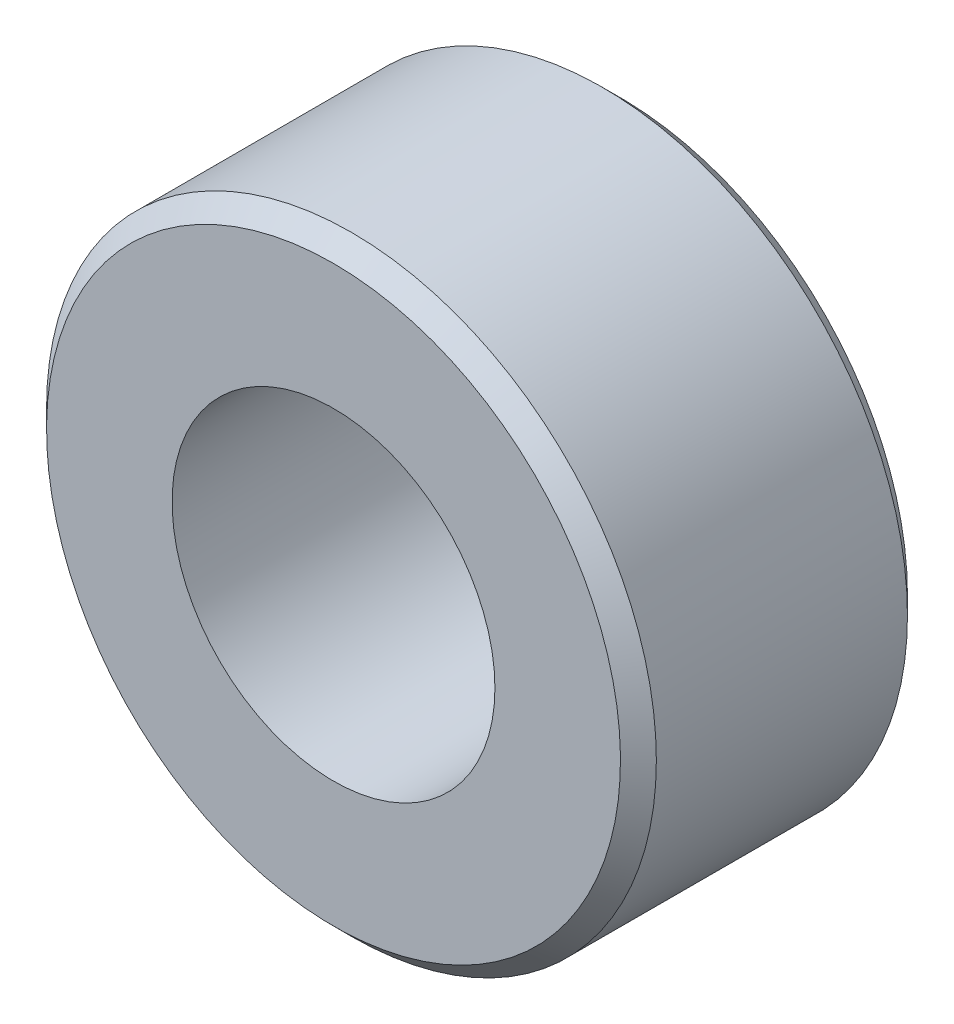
ISO-10303-21;
HEADER;
FILE_DESCRIPTION(('STEP AP214'),'2;1');
FILE_NAME('part.step','',(''),(''),'','','');
FILE_SCHEMA(('AUTOMOTIVE_DESIGN { 1 0 10303 214 1 1 1 1 }'));
ENDSEC;
DATA;
#1=APPLICATION_CONTEXT('core data for automotive mechanical design processes');
#2=APPLICATION_PROTOCOL_DEFINITION('international standard','automotive_design',2000,#1);
#3=PRODUCT_CONTEXT('',#1,'mechanical');
#4=PRODUCT('Part','Part','',(#3));
#5=PRODUCT_RELATED_PRODUCT_CATEGORY('part','',(#4));
#6=PRODUCT_DEFINITION_FORMATION('','',#4);
#7=PRODUCT_DEFINITION_CONTEXT('part definition',#1,'design');
#8=PRODUCT_DEFINITION('design','',#6,#7);
#9=PRODUCT_DEFINITION_SHAPE('','',#8);
#10=(LENGTH_UNIT() NAMED_UNIT(*) SI_UNIT(.MILLI.,.METRE.));
#11=(NAMED_UNIT(*) PLANE_ANGLE_UNIT() SI_UNIT($,.RADIAN.));
#12=(NAMED_UNIT(*) SI_UNIT($,.STERADIAN.) SOLID_ANGLE_UNIT());
#13=UNCERTAINTY_MEASURE_WITH_UNIT(LENGTH_MEASURE(1.E-05),#10,'distance_accuracy_value','');
#14=(GEOMETRIC_REPRESENTATION_CONTEXT(3) GLOBAL_UNCERTAINTY_ASSIGNED_CONTEXT((#13)) GLOBAL_UNIT_ASSIGNED_CONTEXT((#10,
#11,#12)) REPRESENTATION_CONTEXT('',''));
#15=CARTESIAN_POINT('',(0.,0.,0.));
#16=DIRECTION('',(0.,0.,1.));
#17=DIRECTION('',(1.,0.,0.));
#18=AXIS2_PLACEMENT_3D('',#15,#16,#17);
#19=CARTESIAN_POINT('',(0.,0.,0.));
#20=DIRECTION('',(0.,0.,1.));
#21=DIRECTION('',(1.,0.,0.));
#22=AXIS2_PLACEMENT_3D('',#19,#20,#21);
#23=CYLINDRICAL_SURFACE('',#22,4.5);
#24=CARTESIAN_POINT('',(0.,0.,8.));
#25=DIRECTION('',(0.,0.,1.));
#26=DIRECTION('',(1.,0.,0.));
#27=AXIS2_PLACEMENT_3D('',#24,#25,#26);
#28=CIRCLE('',#27,4.5);
#29=CARTESIAN_POINT('',(4.5,0.,8.));
#30=VERTEX_POINT('',#29);
#31=EDGE_CURVE('E34',#30,#30,#28,.T.);
#32=ORIENTED_EDGE('',*,*,#31,.T.);
#33=EDGE_LOOP('',(#32));
#34=FACE_BOUND('',#33,.T.);
#35=CARTESIAN_POINT('',(0.,0.,0.));
#36=DIRECTION('',(0.,0.,1.));
#37=DIRECTION('',(1.,0.,0.));
#38=AXIS2_PLACEMENT_3D('',#35,#36,#37);
#39=CIRCLE('',#38,4.5);
#40=CARTESIAN_POINT('',(4.5,0.,0.));
#41=VERTEX_POINT('',#40);
#42=EDGE_CURVE('E18',#41,#41,#39,.T.);
#43=ORIENTED_EDGE('',*,*,#42,.F.);
#44=EDGE_LOOP('',(#43));
#45=FACE_BOUND('',#44,.T.);
#46=ADVANCED_FACE('F14',(#34,#45),#23,.F.);
#47=CARTESIAN_POINT('',(0.,0.,0.));
#48=DIRECTION('',(0.,0.,-1.));
#49=DIRECTION('',(-1.,0.,0.));
#50=AXIS2_PLACEMENT_3D('',#47,#48,#49);
#51=PLANE('',#50);
#52=CARTESIAN_POINT('',(0.,0.,0.));
#53=DIRECTION('',(0.,0.,1.));
#54=DIRECTION('',(1.,0.,0.));
#55=AXIS2_PLACEMENT_3D('',#52,#53,#54);
#56=CIRCLE('',#55,8.);
#57=CARTESIAN_POINT('',(8.,0.,0.));
#58=VERTEX_POINT('',#57);
#59=EDGE_CURVE('E32',#58,#58,#56,.T.);
#60=ORIENTED_EDGE('',*,*,#59,.F.);
#61=EDGE_LOOP('',(#60));
#62=FACE_BOUND('',#61,.T.);
#63=ORIENTED_EDGE('',*,*,#42,.T.);
#64=EDGE_LOOP('',(#63));
#65=FACE_BOUND('',#64,.T.);
#66=ADVANCED_FACE('F41',(#62,#65),#51,.T.);
#67=CARTESIAN_POINT('',(0.,0.,8.));
#68=DIRECTION('',(0.,0.,-1.));
#69=DIRECTION('',(-1.,0.,0.));
#70=AXIS2_PLACEMENT_3D('',#67,#68,#69);
#71=PLANE('',#70);
#72=CARTESIAN_POINT('',(0.,0.,8.));
#73=DIRECTION('',(0.,0.,-1.));
#74=DIRECTION('',(0.,1.,0.));
#75=AXIS2_PLACEMENT_3D('',#72,#73,#74);
#76=CIRCLE('',#75,8.);
#77=CARTESIAN_POINT('',(0.,8.,8.));
#78=VERTEX_POINT('',#77);
#79=EDGE_CURVE('E27',#78,#78,#76,.T.);
#80=ORIENTED_EDGE('',*,*,#79,.F.);
#81=EDGE_LOOP('',(#80));
#82=FACE_BOUND('',#81,.T.);
#83=ORIENTED_EDGE('',*,*,#31,.F.);
#84=EDGE_LOOP('',(#83));
#85=FACE_BOUND('',#84,.T.);
#86=ADVANCED_FACE('F48',(#82,#85),#71,.F.);
#87=CARTESIAN_POINT('',(0.,0.,0.5));
#88=DIRECTION('',(0.,0.,1.));
#89=DIRECTION('',(1.,0.,0.));
#90=AXIS2_PLACEMENT_3D('',#87,#88,#89);
#91=CONICAL_SURFACE('',#90,8.5,0.785398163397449);
#92=ORIENTED_EDGE('',*,*,#59,.T.);
#93=EDGE_LOOP('',(#92));
#94=FACE_BOUND('',#93,.T.);
#95=CARTESIAN_POINT('',(0.,0.,0.5));
#96=DIRECTION('',(0.,0.,1.));
#97=DIRECTION('',(1.,0.,0.));
#98=AXIS2_PLACEMENT_3D('',#95,#96,#97);
#99=CIRCLE('',#98,8.5);
#100=CARTESIAN_POINT('',(8.5,0.,0.5));
#101=VERTEX_POINT('',#100);
#102=EDGE_CURVE('E22',#101,#101,#99,.T.);
#103=ORIENTED_EDGE('',*,*,#102,.F.);
#104=EDGE_LOOP('',(#103));
#105=FACE_BOUND('',#104,.T.);
#106=ADVANCED_FACE('F56',(#94,#105),#91,.T.);
#107=CARTESIAN_POINT('',(0.,0.,7.5));
#108=DIRECTION('',(0.,0.,-1.));
#109=DIRECTION('',(0.,1.,0.));
#110=AXIS2_PLACEMENT_3D('',#107,#108,#109);
#111=CONICAL_SURFACE('',#110,8.5,0.785398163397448);
#112=ORIENTED_EDGE('',*,*,#79,.T.);
#113=EDGE_LOOP('',(#112));
#114=FACE_BOUND('',#113,.T.);
#115=CARTESIAN_POINT('',(0.,0.,7.5));
#116=DIRECTION('',(0.,0.,1.));
#117=DIRECTION('',(1.,0.,0.));
#118=AXIS2_PLACEMENT_3D('',#115,#116,#117);
#119=CIRCLE('',#118,8.5);
#120=CARTESIAN_POINT('',(8.5,0.,7.5));
#121=VERTEX_POINT('',#120);
#122=EDGE_CURVE('E9',#121,#121,#119,.F.);
#123=ORIENTED_EDGE('',*,*,#122,.F.);
#124=EDGE_LOOP('',(#123));
#125=FACE_BOUND('',#124,.T.);
#126=ADVANCED_FACE('F52',(#114,#125),#111,.T.);
#127=CARTESIAN_POINT('',(0.,0.,0.));
#128=DIRECTION('',(0.,0.,1.));
#129=DIRECTION('',(1.,0.,0.));
#130=AXIS2_PLACEMENT_3D('',#127,#128,#129);
#131=CYLINDRICAL_SURFACE('',#130,8.5);
#132=ORIENTED_EDGE('',*,*,#102,.T.);
#133=EDGE_LOOP('',(#132));
#134=FACE_BOUND('',#133,.T.);
#135=ORIENTED_EDGE('',*,*,#122,.T.);
#136=EDGE_LOOP('',(#135));
#137=FACE_BOUND('',#136,.T.);
#138=ADVANCED_FACE('F16',(#134,#137),#131,.T.);
#139=CLOSED_SHELL('',(#46,#66,#86,#106,#126,#138));
#140=MANIFOLD_SOLID_BREP('B1',#139);
#141=ADVANCED_BREP_SHAPE_REPRESENTATION('',(#18,#140),#14);
#142=SHAPE_DEFINITION_REPRESENTATION(#9,#141);
ENDSEC;
END-ISO-10303-21;
